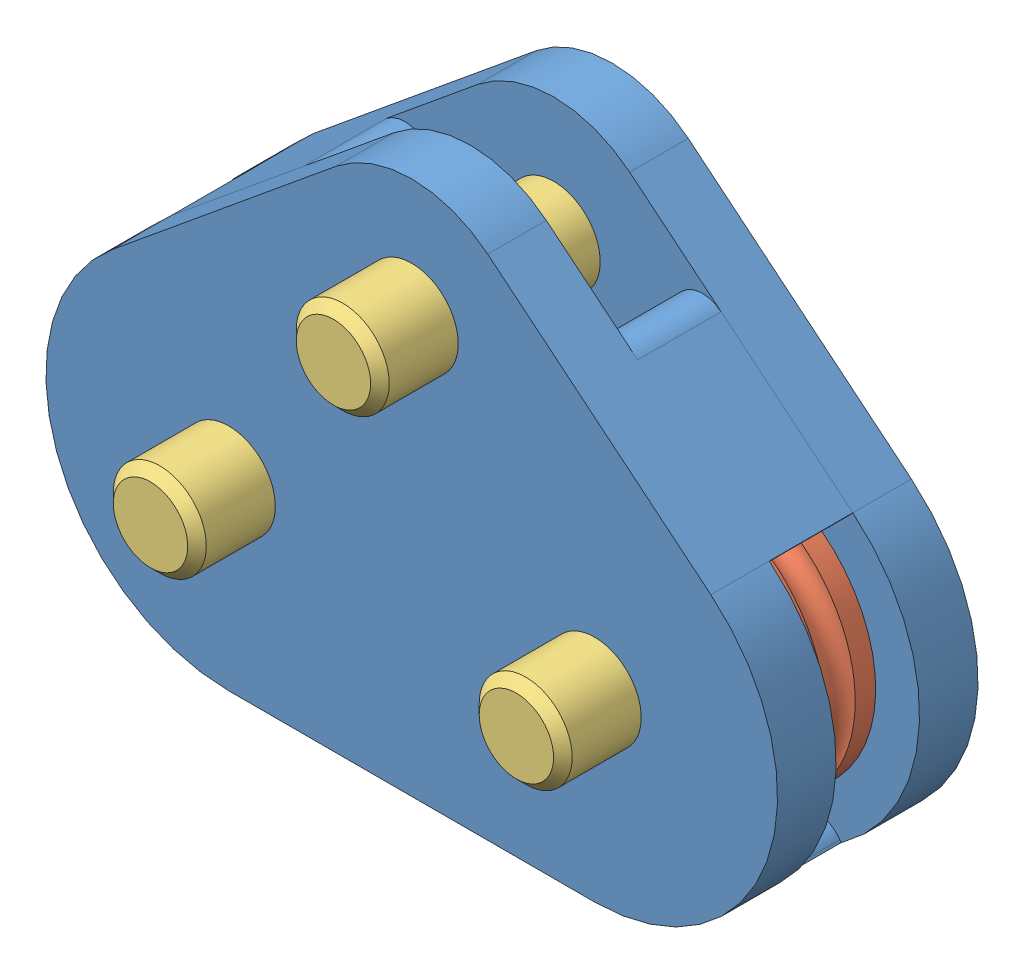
SolidWorks assembly block_drive.SLDASM, configuration Default (file format 5000). Lengths in mm.
Overall size (25 18.27 9.52).
7 component instances, 3 part files, 13 mates.
Components (placement in the parent):
- b1-1: b1.SLDPRT [Default] at (-4.5738 -0.222 -1.7723) size (25 18.27 4.85)
- b1-2: b1.SLDPRT [Default] at (-4.5738 -0.222 5.0777) x (-1 0 0) z (0 0 -1) size (25 18.27 4.85)
- pulley-1: pulley.SLDPRT [Default] at (-10.8238 -0.222 1.4277) x (1 0 0) z (0 1 0) size (9.5 2.4 9.5)
- pulley-2: pulley.SLDPRT [Default] at (1.6762 -0.222 1.4277) x (1 0 0) z (0 1 0) size (9.5 2.4 9.5)
- 97395A435-1: 97395A435.SLDPRT [97395A435] at (-4.5738 7.7155 2.9902) x (0 0 1) z (-1 0 0) size (9.53 3.17 3.17)
- 97395A435-4: 97395A435.SLDPRT [97395A435] at (-10.8238 -0.222 2.9902) x (0 0 -1) z (0.998449 -0.055671 0) size (9.53 3.17 3.17)
- 97395A435-3: 97395A435.SLDPRT [97395A435] at (1.6762 -0.222 2.9902) x (0 0 1) z (-1 0 0) size (9.53 3.17 3.17)
Mates (geometry in assembly coordinates):
- Concentric1: concentric anti-aligned: cylinder of b1-1 through (1.6762 -0.222 -1.7723) axis (0 0 1) radius 1.5875; cylinder of b1-2 through (1.6762 -0.222 5.0777) axis (0 0 -1) radius 1.5875
- Concentric2: concentric anti-aligned: cylinder of b1-1 through (-4.5738 7.7155 -23.4405) axis (0 0 1) radius 1.5875; cylinder of b1-2 through (-4.5738 7.7155 26.7459) axis (0 0 -1) radius 1.5875
- Coincident1: coincident anti-aligned: plane of b1-1 through (-4.5738 -0.222 3.0777) normal (0 0 1); plane of b1-2 through (1.6762 -0.222 3.0777) normal (0 0 -1)
- Concentric3: concentric anti-aligned: cylinder of b1-2 through (-10.8238 -0.222 5.0777) axis (0 0 -1) radius 1.5875; cylinder of pulley-1 through (-10.8238 -0.222 1.4277) axis (0 0 1) radius 1.5
- Concentric4: concentric anti-aligned: cylinder of b1-2 through (1.6762 -0.222 5.0777) axis (0 0 -1) radius 1.5875; cylinder of pulley-2 through (1.6762 -0.222 1.4277) axis (0 0 1) radius 1.5
- Coincident2: coincident anti-aligned: plane of b1-1 through (-10.8238 -0.222 0.2277) normal (0 0 1); plane of pulley-1 through (-9.3238 -0.222 0.2277) normal (0 0 -1)
- Coincident3: coincident anti-aligned: plane of b1-1 through (-10.8238 -0.222 0.2277) normal (0 0 1); plane of pulley-2 through (3.1762 -0.222 0.2277) normal (0 0 -1)
- Concentric6: concentric anti-aligned: cylinder of b1-2 through (-4.5738 7.7155 26.7459) axis (0 0 -1) radius 1.5875; cylinder of 97395A435-1 through (-4.5738 7.7155 -1.7723) axis (0 0 1) radius 1.5875
- Coincident5: coincident aligned: plane of b1-1 through (-10.8238 -0.222 -1.7723) normal (0 0 -1); plane of 97395A435-1 through (-4.5738 7.7155 -1.7723) normal (0 0 -1)
- Concentric7: concentric anti-aligned: cylinder of b1-1 through (-10.8238 -0.222 -1.7723) axis (0 0 1) radius 1.5875; cylinder of 97395A435-4 through (-10.8238 -0.222 7.7527) axis (0 0 -1) radius 1.5875
- Coincident6: coincident aligned: plane of b1-1 through (-10.8238 -0.222 -1.7723) normal (0 0 -1); plane of 97395A435-4 through (-10.8238 -0.222 -1.7723) normal (0 0 -1)
- Concentric8: concentric anti-aligned: cylinder of b1-2 through (1.6762 -0.222 5.0777) axis (0 0 -1) radius 1.5875; cylinder of 97395A435-3 through (1.6762 -0.222 -1.7723) axis (0 0 1) radius 1.5875
- Coincident7: coincident aligned: plane of b1-1 through (-10.8238 -0.222 -1.7723) normal (0 0 -1); plane of 97395A435-3 through (1.6762 -0.222 -1.7723) normal (0 0 -1)
